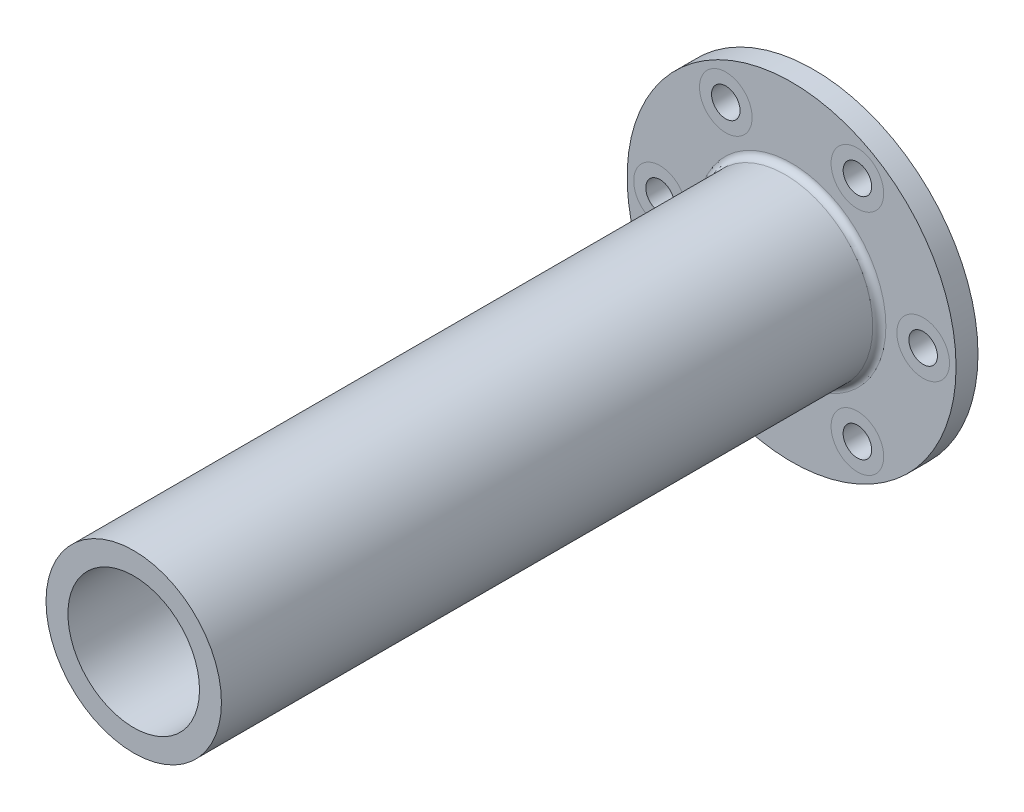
from build123d import *

# Parameters (mm, degrees)
SKETCH1_R          = 75
EXTRUDE1_DEPTH     = 10
SKETCH2_R          = 40
EXTRUDE2_DEPTH     = 300
SKETCH3_R          = 30
CUT_EXTRUDE1_DEPTH = 328.643098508
FILLET1_R          = 3
SKETCH4_R          = 6.5
CUT_EXTRUDE2_DEPTH = 328.643098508
CIRPATTERN1_COUNT  = 6


with BuildPart() as part:
    # Sketch1 → Extrude1 (new body)
    with BuildSketch(Plane.XY):
        Circle(SKETCH1_R)
    extrude(amount=EXTRUDE1_DEPTH)

    # Sketch2 → Extrude2 (add)
    with BuildSketch(Plane.XY.offset(10)):
        Circle(SKETCH2_R)
    extrude(amount=EXTRUDE2_DEPTH)

    # Sketch3 → Cut-Extrude1 (cut, through all)
    with BuildSketch(Plane.XY.offset(310)):
        Circle(SKETCH3_R)
    cut_extrude1 = extrude(amount=-CUT_EXTRUDE1_DEPTH, mode=Mode.SUBTRACT)

    # Fillet1
    fillet1_edges = [part.edges().sort_by_distance(p)[0] for p in [
        (-40, 0, 10),
    ]]
    fillet(fillet1_edges, radius=FILLET1_R)

    # Sketch4 → Cut-Extrude2 (cut, through all)
    with BuildSketch(Plane(origin=(0, 0, 0), x_dir=(-1, 0, 0), z_dir=(0, 0, -1))):
        with Locations((60, 0)):
            Circle(SKETCH4_R)
    cut_extrude2 = extrude(amount=-CUT_EXTRUDE2_DEPTH, mode=Mode.SUBTRACT)

    # CirPattern1: Cut-Extrude1, Cut-Extrude2 ×6 about axis
    cirpattern1_axis = Axis((0, 0, 0), (0, 0, 1))
    add([cut_extrude1.rotate(cirpattern1_axis, i * 360 / CIRPATTERN1_COUNT) for i in range(1, CIRPATTERN1_COUNT)], mode=Mode.SUBTRACT)
    add([cut_extrude2.rotate(cirpattern1_axis, i * 360 / CIRPATTERN1_COUNT) for i in range(1, CIRPATTERN1_COUNT)], mode=Mode.SUBTRACT)


solid = part.part
